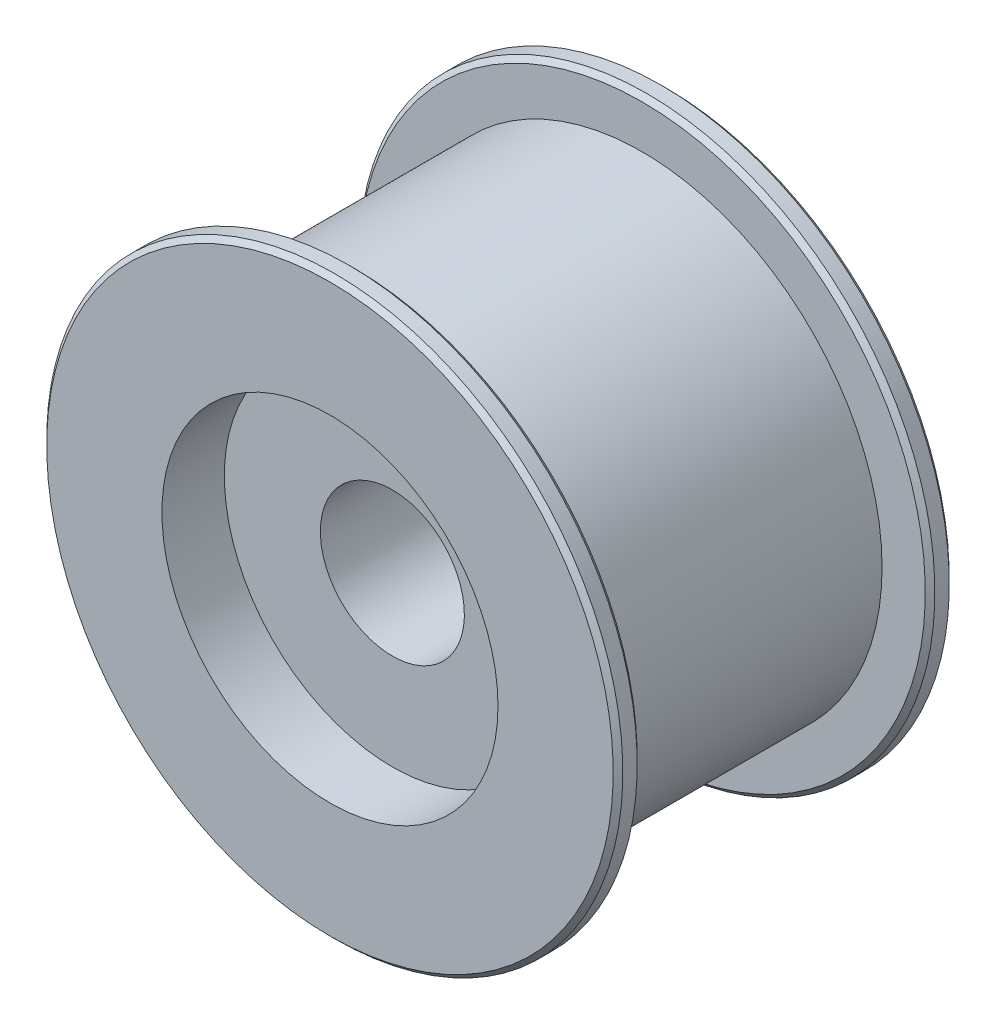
ISO-10303-21;
HEADER;
FILE_DESCRIPTION(('STEP AP214'),'2;1');
FILE_NAME('part.step','',(''),(''),'','','');
FILE_SCHEMA(('AUTOMOTIVE_DESIGN { 1 0 10303 214 1 1 1 1 }'));
ENDSEC;
DATA;
#1=APPLICATION_CONTEXT('core data for automotive mechanical design processes');
#2=APPLICATION_PROTOCOL_DEFINITION('international standard','automotive_design',2000,#1);
#3=PRODUCT_CONTEXT('',#1,'mechanical');
#4=PRODUCT('Part','Part','',(#3));
#5=PRODUCT_RELATED_PRODUCT_CATEGORY('part','',(#4));
#6=PRODUCT_DEFINITION_FORMATION('','',#4);
#7=PRODUCT_DEFINITION_CONTEXT('part definition',#1,'design');
#8=PRODUCT_DEFINITION('design','',#6,#7);
#9=PRODUCT_DEFINITION_SHAPE('','',#8);
#10=(LENGTH_UNIT() NAMED_UNIT(*) SI_UNIT(.MILLI.,.METRE.));
#11=(NAMED_UNIT(*) PLANE_ANGLE_UNIT() SI_UNIT($,.RADIAN.));
#12=(NAMED_UNIT(*) SI_UNIT($,.STERADIAN.) SOLID_ANGLE_UNIT());
#13=UNCERTAINTY_MEASURE_WITH_UNIT(LENGTH_MEASURE(1.E-05),#10,'distance_accuracy_value','');
#14=(GEOMETRIC_REPRESENTATION_CONTEXT(3) GLOBAL_UNCERTAINTY_ASSIGNED_CONTEXT((#13)) GLOBAL_UNIT_ASSIGNED_CONTEXT((#10,
#11,#12)) REPRESENTATION_CONTEXT('',''));
#15=CARTESIAN_POINT('',(0.,0.,0.));
#16=DIRECTION('',(0.,0.,1.));
#17=DIRECTION('',(1.,0.,0.));
#18=AXIS2_PLACEMENT_3D('',#15,#16,#17);
#19=CARTESIAN_POINT('',(0.,-14.999999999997,11.));
#20=DIRECTION('',(0.,0.,-1.));
#21=DIRECTION('',(0.,-1.,0.));
#22=AXIS2_PLACEMENT_3D('',#19,#20,#21);
#23=PLANE('',#22);
#24=CARTESIAN_POINT('',(0.,0.,11.));
#25=DIRECTION('',(0.,0.,1.));
#26=DIRECTION('',(0.,1.,0.));
#27=AXIS2_PLACEMENT_3D('',#24,#25,#26);
#28=CIRCLE('',#27,7.49999999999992);
#29=CARTESIAN_POINT('',(0.,7.49999999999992,11.));
#30=VERTEX_POINT('',#29);
#31=EDGE_CURVE('E8',#30,#30,#28,.T.);
#32=ORIENTED_EDGE('',*,*,#31,.F.);
#33=EDGE_LOOP('',(#32));
#34=FACE_BOUND('',#33,.T.);
#35=CARTESIAN_POINT('',(0.,0.,11.));
#36=DIRECTION('',(0.,0.,1.));
#37=DIRECTION('',(1.,0.,0.));
#38=AXIS2_PLACEMENT_3D('',#35,#36,#37);
#39=CIRCLE('',#38,17.499999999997);
#40=CARTESIAN_POINT('',(17.499999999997,0.,11.));
#41=VERTEX_POINT('',#40);
#42=EDGE_CURVE('E52',#41,#41,#39,.T.);
#43=ORIENTED_EDGE('',*,*,#42,.T.);
#44=EDGE_LOOP('',(#43));
#45=FACE_BOUND('',#44,.T.);
#46=ADVANCED_FACE('F12',(#34,#45),#23,.F.);
#47=CARTESIAN_POINT('',(0.,0.,22.));
#48=DIRECTION('',(0.,0.,1.));
#49=DIRECTION('',(0.,1.,0.));
#50=AXIS2_PLACEMENT_3D('',#47,#48,#49);
#51=CYLINDRICAL_SURFACE('',#50,7.49999999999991);
#52=CARTESIAN_POINT('',(0.,0.,-11.0000000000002));
#53=DIRECTION('',(0.,0.,1.));
#54=DIRECTION('',(0.,1.,0.));
#55=AXIS2_PLACEMENT_3D('',#52,#53,#54);
#56=CIRCLE('',#55,7.4999999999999);
#57=CARTESIAN_POINT('',(0.,7.4999999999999,-11.0000000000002));
#58=VERTEX_POINT('',#57);
#59=EDGE_CURVE('E18',#58,#58,#56,.T.);
#60=ORIENTED_EDGE('',*,*,#59,.F.);
#61=EDGE_LOOP('',(#60));
#62=FACE_BOUND('',#61,.T.);
#63=ORIENTED_EDGE('',*,*,#31,.T.);
#64=EDGE_LOOP('',(#63));
#65=FACE_BOUND('',#64,.T.);
#66=ADVANCED_FACE('F84',(#62,#65),#51,.F.);
#67=CARTESIAN_POINT('',(0.,-14.,-11.0000000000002));
#68=DIRECTION('',(0.,0.,1.));
#69=DIRECTION('',(0.,1.,0.));
#70=AXIS2_PLACEMENT_3D('',#67,#68,#69);
#71=PLANE('',#70);
#72=CARTESIAN_POINT('',(0.,0.,-11.0000000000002));
#73=DIRECTION('',(0.,0.,1.));
#74=DIRECTION('',(0.,1.,0.));
#75=AXIS2_PLACEMENT_3D('',#72,#73,#74);
#76=CIRCLE('',#75,14.);
#77=CARTESIAN_POINT('',(0.,14.,-11.0000000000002));
#78=VERTEX_POINT('',#77);
#79=EDGE_CURVE('E22',#78,#78,#76,.T.);
#80=ORIENTED_EDGE('',*,*,#79,.F.);
#81=EDGE_LOOP('',(#80));
#82=FACE_BOUND('',#81,.T.);
#83=ORIENTED_EDGE('',*,*,#59,.T.);
#84=EDGE_LOOP('',(#83));
#85=FACE_BOUND('',#84,.T.);
#86=ADVANCED_FACE('F72',(#82,#85),#71,.F.);
#87=CARTESIAN_POINT('',(0.,0.,22.));
#88=DIRECTION('',(0.,0.,1.));
#89=DIRECTION('',(0.,1.,0.));
#90=AXIS2_PLACEMENT_3D('',#87,#88,#89);
#91=CYLINDRICAL_SURFACE('',#90,14.);
#92=ORIENTED_EDGE('',*,*,#79,.T.);
#93=EDGE_LOOP('',(#92));
#94=FACE_BOUND('',#93,.T.);
#95=CARTESIAN_POINT('',(0.,0.,-17.5));
#96=DIRECTION('',(0.,0.,1.));
#97=DIRECTION('',(1.,0.,0.));
#98=AXIS2_PLACEMENT_3D('',#95,#96,#97);
#99=CIRCLE('',#98,14.);
#100=CARTESIAN_POINT('',(14.,0.,-17.5));
#101=VERTEX_POINT('',#100);
#102=EDGE_CURVE('E64',#101,#101,#99,.T.);
#103=ORIENTED_EDGE('',*,*,#102,.F.);
#104=EDGE_LOOP('',(#103));
#105=FACE_BOUND('',#104,.T.);
#106=ADVANCED_FACE('F70',(#94,#105),#91,.F.);
#107=CARTESIAN_POINT('',(0.,-29.5,-17.5));
#108=DIRECTION('',(0.,0.,1.));
#109=DIRECTION('',(0.,1.,0.));
#110=AXIS2_PLACEMENT_3D('',#107,#108,#109);
#111=PLANE('',#110);
#112=CARTESIAN_POINT('',(0.,0.,-17.5));
#113=DIRECTION('',(0.,0.,1.));
#114=DIRECTION('',(0.,1.,0.));
#115=AXIS2_PLACEMENT_3D('',#112,#113,#114);
#116=CIRCLE('',#115,29.5);
#117=CARTESIAN_POINT('',(0.,29.5,-17.5));
#118=VERTEX_POINT('',#117);
#119=EDGE_CURVE('E26',#118,#118,#116,.T.);
#120=ORIENTED_EDGE('',*,*,#119,.F.);
#121=EDGE_LOOP('',(#120));
#122=FACE_BOUND('',#121,.T.);
#123=ORIENTED_EDGE('',*,*,#102,.T.);
#124=EDGE_LOOP('',(#123));
#125=FACE_BOUND('',#124,.T.);
#126=ADVANCED_FACE('F68',(#122,#125),#111,.F.);
#127=CARTESIAN_POINT('',(0.,0.,-17.5));
#128=DIRECTION('',(0.,0.,1.));
#129=DIRECTION('',(0.,1.,0.));
#130=AXIS2_PLACEMENT_3D('',#127,#128,#129);
#131=CONICAL_SURFACE('',#130,29.5,0.785398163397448);
#132=CARTESIAN_POINT('',(0.,0.,-17.));
#133=DIRECTION('',(0.,0.,1.));
#134=DIRECTION('',(0.,1.,0.));
#135=AXIS2_PLACEMENT_3D('',#132,#133,#134);
#136=CIRCLE('',#135,30.);
#137=CARTESIAN_POINT('',(0.,30.,-17.));
#138=VERTEX_POINT('',#137);
#139=EDGE_CURVE('E31',#138,#138,#136,.T.);
#140=ORIENTED_EDGE('',*,*,#139,.F.);
#141=EDGE_LOOP('',(#140));
#142=FACE_BOUND('',#141,.T.);
#143=ORIENTED_EDGE('',*,*,#119,.T.);
#144=EDGE_LOOP('',(#143));
#145=FACE_BOUND('',#144,.T.);
#146=ADVANCED_FACE('F81',(#142,#145),#131,.T.);
#147=CARTESIAN_POINT('',(0.,0.,22.));
#148=DIRECTION('',(0.,0.,1.));
#149=DIRECTION('',(0.,1.,0.));
#150=AXIS2_PLACEMENT_3D('',#147,#148,#149);
#151=CYLINDRICAL_SURFACE('',#150,30.);
#152=CARTESIAN_POINT('',(0.,0.,-15.5));
#153=DIRECTION('',(0.,0.,1.));
#154=DIRECTION('',(0.,1.,0.));
#155=AXIS2_PLACEMENT_3D('',#152,#153,#154);
#156=CIRCLE('',#155,30.);
#157=CARTESIAN_POINT('',(0.,30.,-15.5));
#158=VERTEX_POINT('',#157);
#159=EDGE_CURVE('E34',#158,#158,#156,.T.);
#160=ORIENTED_EDGE('',*,*,#159,.F.);
#161=EDGE_LOOP('',(#160));
#162=FACE_BOUND('',#161,.T.);
#163=ORIENTED_EDGE('',*,*,#139,.T.);
#164=EDGE_LOOP('',(#163));
#165=FACE_BOUND('',#164,.T.);
#166=ADVANCED_FACE('F138',(#162,#165),#151,.T.);
#167=CARTESIAN_POINT('',(0.,0.,-15.5));
#168=DIRECTION('',(0.,0.,-1.));
#169=DIRECTION('',(0.,-1.,0.));
#170=AXIS2_PLACEMENT_3D('',#167,#168,#169);
#171=CONICAL_SURFACE('',#170,30.,0.785398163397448);
#172=CARTESIAN_POINT('',(0.,0.,-15.));
#173=DIRECTION('',(0.,0.,1.));
#174=DIRECTION('',(0.,1.,0.));
#175=AXIS2_PLACEMENT_3D('',#172,#173,#174);
#176=CIRCLE('',#175,29.5);
#177=CARTESIAN_POINT('',(0.,29.5,-15.));
#178=VERTEX_POINT('',#177);
#179=EDGE_CURVE('E37',#178,#178,#176,.T.);
#180=ORIENTED_EDGE('',*,*,#179,.F.);
#181=EDGE_LOOP('',(#180));
#182=FACE_BOUND('',#181,.T.);
#183=ORIENTED_EDGE('',*,*,#159,.T.);
#184=EDGE_LOOP('',(#183));
#185=FACE_BOUND('',#184,.T.);
#186=ADVANCED_FACE('F134',(#182,#185),#171,.T.);
#187=CARTESIAN_POINT('',(0.,-25.4,-15.));
#188=DIRECTION('',(0.,0.,-1.));
#189=DIRECTION('',(0.,-1.,0.));
#190=AXIS2_PLACEMENT_3D('',#187,#188,#189);
#191=PLANE('',#190);
#192=CARTESIAN_POINT('',(0.,0.,-15.));
#193=DIRECTION('',(0.,0.,1.));
#194=DIRECTION('',(1.,0.,0.));
#195=AXIS2_PLACEMENT_3D('',#192,#193,#194);
#196=CIRCLE('',#195,25.);
#197=CARTESIAN_POINT('',(25.,0.,-15.));
#198=VERTEX_POINT('',#197);
#199=EDGE_CURVE('E58',#198,#198,#196,.T.);
#200=ORIENTED_EDGE('',*,*,#199,.F.);
#201=EDGE_LOOP('',(#200));
#202=FACE_BOUND('',#201,.T.);
#203=ORIENTED_EDGE('',*,*,#179,.T.);
#204=EDGE_LOOP('',(#203));
#205=FACE_BOUND('',#204,.T.);
#206=ADVANCED_FACE('F130',(#202,#205),#191,.F.);
#207=CARTESIAN_POINT('',(0.,0.,22.));
#208=DIRECTION('',(0.,0.,1.));
#209=DIRECTION('',(0.,1.,0.));
#210=AXIS2_PLACEMENT_3D('',#207,#208,#209);
#211=CYLINDRICAL_SURFACE('',#210,25.);
#212=CARTESIAN_POINT('',(0.,0.,15.));
#213=DIRECTION('',(0.,0.,1.));
#214=DIRECTION('',(1.,0.,0.));
#215=AXIS2_PLACEMENT_3D('',#212,#213,#214);
#216=CIRCLE('',#215,25.);
#217=CARTESIAN_POINT('',(25.,0.,15.));
#218=VERTEX_POINT('',#217);
#219=EDGE_CURVE('E55',#218,#218,#216,.T.);
#220=ORIENTED_EDGE('',*,*,#219,.F.);
#221=EDGE_LOOP('',(#220));
#222=FACE_BOUND('',#221,.T.);
#223=ORIENTED_EDGE('',*,*,#199,.T.);
#224=EDGE_LOOP('',(#223));
#225=FACE_BOUND('',#224,.T.);
#226=ADVANCED_FACE('F126',(#222,#225),#211,.T.);
#227=CARTESIAN_POINT('',(0.,-25.4,15.));
#228=DIRECTION('',(0.,0.,1.));
#229=DIRECTION('',(0.,1.,0.));
#230=AXIS2_PLACEMENT_3D('',#227,#228,#229);
#231=PLANE('',#230);
#232=CARTESIAN_POINT('',(0.,0.,15.));
#233=DIRECTION('',(0.,0.,1.));
#234=DIRECTION('',(0.,1.,0.));
#235=AXIS2_PLACEMENT_3D('',#232,#233,#234);
#236=CIRCLE('',#235,29.5);
#237=CARTESIAN_POINT('',(0.,29.5,15.));
#238=VERTEX_POINT('',#237);
#239=EDGE_CURVE('E40',#238,#238,#236,.T.);
#240=ORIENTED_EDGE('',*,*,#239,.F.);
#241=EDGE_LOOP('',(#240));
#242=FACE_BOUND('',#241,.T.);
#243=ORIENTED_EDGE('',*,*,#219,.T.);
#244=EDGE_LOOP('',(#243));
#245=FACE_BOUND('',#244,.T.);
#246=ADVANCED_FACE('F122',(#242,#245),#231,.F.);
#247=CARTESIAN_POINT('',(0.,0.,15.));
#248=DIRECTION('',(0.,0.,1.));
#249=DIRECTION('',(0.,1.,0.));
#250=AXIS2_PLACEMENT_3D('',#247,#248,#249);
#251=CONICAL_SURFACE('',#250,29.5,0.785398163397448);
#252=CARTESIAN_POINT('',(0.,0.,15.5));
#253=DIRECTION('',(0.,0.,1.));
#254=DIRECTION('',(0.,1.,0.));
#255=AXIS2_PLACEMENT_3D('',#252,#253,#254);
#256=CIRCLE('',#255,30.);
#257=CARTESIAN_POINT('',(0.,30.,15.5));
#258=VERTEX_POINT('',#257);
#259=EDGE_CURVE('E43',#258,#258,#256,.T.);
#260=ORIENTED_EDGE('',*,*,#259,.F.);
#261=EDGE_LOOP('',(#260));
#262=FACE_BOUND('',#261,.T.);
#263=ORIENTED_EDGE('',*,*,#239,.T.);
#264=EDGE_LOOP('',(#263));
#265=FACE_BOUND('',#264,.T.);
#266=ADVANCED_FACE('F118',(#262,#265),#251,.T.);
#267=CARTESIAN_POINT('',(0.,0.,22.));
#268=DIRECTION('',(0.,0.,1.));
#269=DIRECTION('',(0.,1.,0.));
#270=AXIS2_PLACEMENT_3D('',#267,#268,#269);
#271=CYLINDRICAL_SURFACE('',#270,30.);
#272=CARTESIAN_POINT('',(0.,0.,17.));
#273=DIRECTION('',(0.,0.,1.));
#274=DIRECTION('',(0.,1.,0.));
#275=AXIS2_PLACEMENT_3D('',#272,#273,#274);
#276=CIRCLE('',#275,30.);
#277=CARTESIAN_POINT('',(0.,30.,17.));
#278=VERTEX_POINT('',#277);
#279=EDGE_CURVE('E46',#278,#278,#276,.T.);
#280=ORIENTED_EDGE('',*,*,#279,.F.);
#281=EDGE_LOOP('',(#280));
#282=FACE_BOUND('',#281,.T.);
#283=ORIENTED_EDGE('',*,*,#259,.T.);
#284=EDGE_LOOP('',(#283));
#285=FACE_BOUND('',#284,.T.);
#286=ADVANCED_FACE('F112',(#282,#285),#271,.T.);
#287=CARTESIAN_POINT('',(0.,0.,17.));
#288=DIRECTION('',(0.,0.,-1.));
#289=DIRECTION('',(0.,-1.,0.));
#290=AXIS2_PLACEMENT_3D('',#287,#288,#289);
#291=CONICAL_SURFACE('',#290,30.,0.785398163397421);
#292=CARTESIAN_POINT('',(0.,0.,17.5));
#293=DIRECTION('',(0.,0.,1.));
#294=DIRECTION('',(0.,1.,0.));
#295=AXIS2_PLACEMENT_3D('',#292,#293,#294);
#296=CIRCLE('',#295,29.5);
#297=CARTESIAN_POINT('',(0.,29.5,17.5));
#298=VERTEX_POINT('',#297);
#299=EDGE_CURVE('E49',#298,#298,#296,.T.);
#300=ORIENTED_EDGE('',*,*,#299,.F.);
#301=EDGE_LOOP('',(#300));
#302=FACE_BOUND('',#301,.T.);
#303=ORIENTED_EDGE('',*,*,#279,.T.);
#304=EDGE_LOOP('',(#303));
#305=FACE_BOUND('',#304,.T.);
#306=ADVANCED_FACE('F105',(#302,#305),#291,.T.);
#307=CARTESIAN_POINT('',(0.,-29.5,17.5));
#308=DIRECTION('',(0.,0.,-1.));
#309=DIRECTION('',(0.,-1.,0.));
#310=AXIS2_PLACEMENT_3D('',#307,#308,#309);
#311=PLANE('',#310);
#312=ORIENTED_EDGE('',*,*,#299,.T.);
#313=EDGE_LOOP('',(#312));
#314=FACE_BOUND('',#313,.T.);
#315=CARTESIAN_POINT('',(0.,0.,17.5));
#316=DIRECTION('',(0.,0.,1.));
#317=DIRECTION('',(1.,0.,0.));
#318=AXIS2_PLACEMENT_3D('',#315,#316,#317);
#319=CIRCLE('',#318,17.499999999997);
#320=CARTESIAN_POINT('',(17.499999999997,0.,17.5));
#321=VERTEX_POINT('',#320);
#322=EDGE_CURVE('E61',#321,#321,#319,.T.);
#323=ORIENTED_EDGE('',*,*,#322,.F.);
#324=EDGE_LOOP('',(#323));
#325=FACE_BOUND('',#324,.T.);
#326=ADVANCED_FACE('F100',(#314,#325),#311,.F.);
#327=CARTESIAN_POINT('',(0.,0.,22.));
#328=DIRECTION('',(0.,0.,1.));
#329=DIRECTION('',(0.,1.,0.));
#330=AXIS2_PLACEMENT_3D('',#327,#328,#329);
#331=CYLINDRICAL_SURFACE('',#330,17.499999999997);
#332=ORIENTED_EDGE('',*,*,#42,.F.);
#333=EDGE_LOOP('',(#332));
#334=FACE_BOUND('',#333,.T.);
#335=ORIENTED_EDGE('',*,*,#322,.T.);
#336=EDGE_LOOP('',(#335));
#337=FACE_BOUND('',#336,.T.);
#338=ADVANCED_FACE('F97',(#334,#337),#331,.F.);
#339=CLOSED_SHELL('',(#46,#66,#86,#106,#126,#146,#166,#186,#206,#226,#246,#266,#286,#306,#326,#338));
#340=MANIFOLD_SOLID_BREP('B1',#339);
#341=ADVANCED_BREP_SHAPE_REPRESENTATION('',(#18,#340),#14);
#342=SHAPE_DEFINITION_REPRESENTATION(#9,#341);
ENDSEC;
END-ISO-10303-21;
